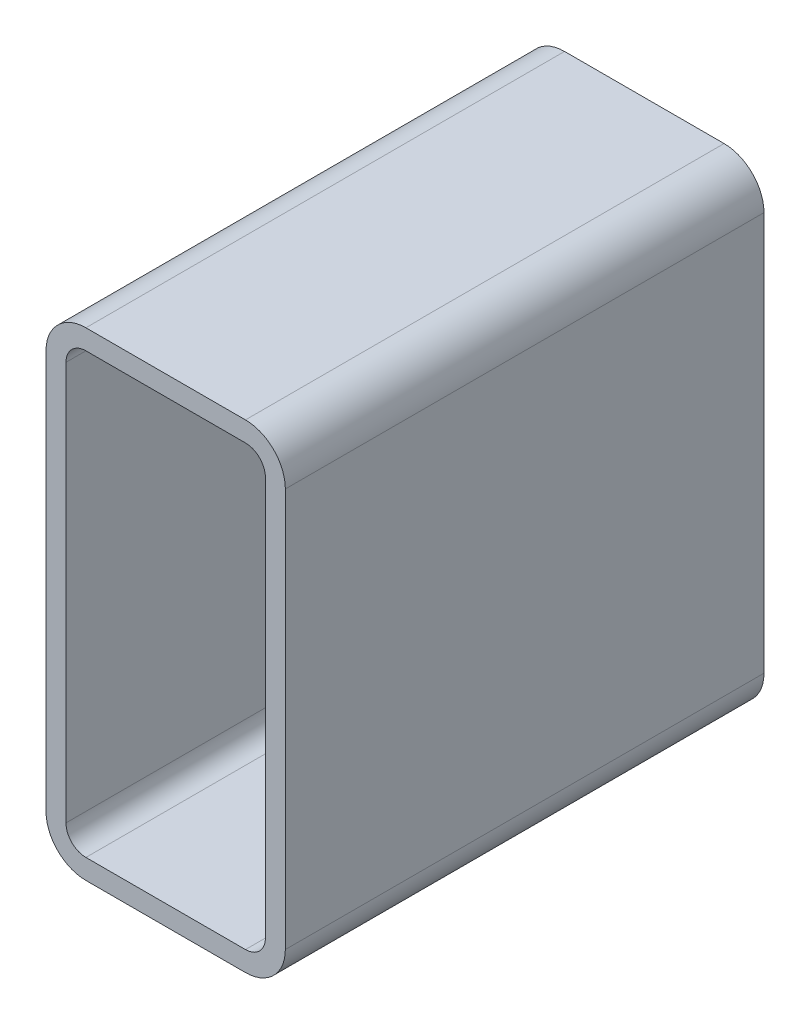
ISO-10303-21;
HEADER;
FILE_DESCRIPTION(('STEP AP214'),'2;1');
FILE_NAME('part.step','',(''),(''),'','','');
FILE_SCHEMA(('AUTOMOTIVE_DESIGN { 1 0 10303 214 1 1 1 1 }'));
ENDSEC;
DATA;
#1=APPLICATION_CONTEXT('core data for automotive mechanical design processes');
#2=APPLICATION_PROTOCOL_DEFINITION('international standard','automotive_design',2000,#1);
#3=PRODUCT_CONTEXT('',#1,'mechanical');
#4=PRODUCT('Part','Part','',(#3));
#5=PRODUCT_RELATED_PRODUCT_CATEGORY('part','',(#4));
#6=PRODUCT_DEFINITION_FORMATION('','',#4);
#7=PRODUCT_DEFINITION_CONTEXT('part definition',#1,'design');
#8=PRODUCT_DEFINITION('design','',#6,#7);
#9=PRODUCT_DEFINITION_SHAPE('','',#8);
#10=(LENGTH_UNIT() NAMED_UNIT(*) SI_UNIT(.MILLI.,.METRE.));
#11=(NAMED_UNIT(*) PLANE_ANGLE_UNIT() SI_UNIT($,.RADIAN.));
#12=(NAMED_UNIT(*) SI_UNIT($,.STERADIAN.) SOLID_ANGLE_UNIT());
#13=UNCERTAINTY_MEASURE_WITH_UNIT(LENGTH_MEASURE(1.E-05),#10,'distance_accuracy_value','');
#14=(GEOMETRIC_REPRESENTATION_CONTEXT(3) GLOBAL_UNCERTAINTY_ASSIGNED_CONTEXT((#13)) GLOBAL_UNIT_ASSIGNED_CONTEXT((#10,
#11,#12)) REPRESENTATION_CONTEXT('',''));
#15=CARTESIAN_POINT('',(0.,0.,0.));
#16=DIRECTION('',(0.,0.,1.));
#17=DIRECTION('',(1.,0.,0.));
#18=AXIS2_PLACEMENT_3D('',#15,#16,#17);
#19=CARTESIAN_POINT('',(25.4473013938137,281.274496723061,304.8));
#20=DIRECTION('',(0.,0.,1.));
#21=DIRECTION('',(1.,0.,0.));
#22=AXIS2_PLACEMENT_3D('',#19,#20,#21);
#23=PLANE('',#22);
#24=CARTESIAN_POINT('',(25.4473013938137,281.274496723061,304.8));
#25=DIRECTION('',(0.,0.,1.));
#26=DIRECTION('',(1.,0.,0.));
#27=AXIS2_PLACEMENT_3D('',#24,#25,#26);
#28=CIRCLE('',#27,25.4);
#29=CARTESIAN_POINT('',(25.4473013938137,306.674496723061,304.8));
#30=VERTEX_POINT('',#29);
#31=CARTESIAN_POINT('',(0.0473013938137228,281.274496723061,304.8));
#32=VERTEX_POINT('',#31);
#33=EDGE_CURVE('E211',#30,#32,#28,.T.);
#34=ORIENTED_EDGE('',*,*,#33,.T.);
#35=DIRECTION('',(0.,-1.,0.));
#36=VECTOR('',#35,1.);
#37=CARTESIAN_POINT('',(0.0473013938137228,27.2744967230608,304.8));
#38=LINE('',#37,#36);
#39=CARTESIAN_POINT('',(0.0473013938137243,27.2744967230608,304.8));
#40=VERTEX_POINT('',#39);
#41=EDGE_CURVE('E214',#32,#40,#38,.T.);
#42=ORIENTED_EDGE('',*,*,#41,.T.);
#43=CARTESIAN_POINT('',(25.4473013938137,27.2744967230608,304.8));
#44=DIRECTION('',(0.,0.,1.));
#45=DIRECTION('',(1.,0.,0.));
#46=AXIS2_PLACEMENT_3D('',#43,#44,#45);
#47=CIRCLE('',#46,25.4);
#48=CARTESIAN_POINT('',(25.4473013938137,1.87449672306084,304.8));
#49=VERTEX_POINT('',#48);
#50=EDGE_CURVE('E217',#40,#49,#47,.T.);
#51=ORIENTED_EDGE('',*,*,#50,.T.);
#52=DIRECTION('',(1.,0.,0.));
#53=VECTOR('',#52,1.);
#54=CARTESIAN_POINT('',(127.047301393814,1.87449672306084,304.8));
#55=LINE('',#54,#53);
#56=CARTESIAN_POINT('',(127.047301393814,1.87449672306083,304.8));
#57=VERTEX_POINT('',#56);
#58=EDGE_CURVE('E219',#49,#57,#55,.T.);
#59=ORIENTED_EDGE('',*,*,#58,.T.);
#60=CARTESIAN_POINT('',(127.047301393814,27.2744967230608,304.8));
#61=DIRECTION('',(0.,0.,1.));
#62=DIRECTION('',(1.,0.,0.));
#63=AXIS2_PLACEMENT_3D('',#60,#61,#62);
#64=CIRCLE('',#63,25.4);
#65=CARTESIAN_POINT('',(152.447301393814,27.2744967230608,304.8));
#66=VERTEX_POINT('',#65);
#67=EDGE_CURVE('E221',#57,#66,#64,.T.);
#68=ORIENTED_EDGE('',*,*,#67,.T.);
#69=DIRECTION('',(0.,1.,0.));
#70=VECTOR('',#69,1.);
#71=CARTESIAN_POINT('',(152.447301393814,281.274496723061,304.8));
#72=LINE('',#71,#70);
#73=CARTESIAN_POINT('',(152.447301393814,281.274496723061,304.8));
#74=VERTEX_POINT('',#73);
#75=EDGE_CURVE('E223',#66,#74,#72,.T.);
#76=ORIENTED_EDGE('',*,*,#75,.T.);
#77=CARTESIAN_POINT('',(127.047301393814,281.274496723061,304.8));
#78=DIRECTION('',(0.,0.,1.));
#79=DIRECTION('',(1.,0.,0.));
#80=AXIS2_PLACEMENT_3D('',#77,#78,#79);
#81=CIRCLE('',#80,25.4);
#82=CARTESIAN_POINT('',(127.047301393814,306.674496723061,304.8));
#83=VERTEX_POINT('',#82);
#84=EDGE_CURVE('E225',#74,#83,#81,.T.);
#85=ORIENTED_EDGE('',*,*,#84,.T.);
#86=DIRECTION('',(-1.,0.,0.));
#87=VECTOR('',#86,1.);
#88=CARTESIAN_POINT('',(25.4473013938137,306.674496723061,304.8));
#89=LINE('',#88,#87);
#90=EDGE_CURVE('E227',#83,#30,#89,.T.);
#91=ORIENTED_EDGE('',*,*,#90,.T.);
#92=EDGE_LOOP('',(#34,#42,#51,#59,#68,#76,#85,#91));
#93=FACE_BOUND('',#92,.T.);
#94=DIRECTION('',(0.,-1.,0.));
#95=VECTOR('',#94,1.);
#96=CARTESIAN_POINT('',(12.7473013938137,27.2744967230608,304.8));
#97=LINE('',#96,#95);
#98=CARTESIAN_POINT('',(12.7473013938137,281.274496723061,304.8));
#99=VERTEX_POINT('',#98);
#100=CARTESIAN_POINT('',(12.7473013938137,27.2744967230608,304.8));
#101=VERTEX_POINT('',#100);
#102=EDGE_CURVE('E154',#99,#101,#97,.T.);
#103=ORIENTED_EDGE('',*,*,#102,.F.);
#104=CARTESIAN_POINT('',(25.4473013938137,281.274496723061,304.8));
#105=DIRECTION('',(0.,0.,1.));
#106=DIRECTION('',(1.,0.,0.));
#107=AXIS2_PLACEMENT_3D('',#104,#105,#106);
#108=CIRCLE('',#107,12.7);
#109=CARTESIAN_POINT('',(25.4473013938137,293.974496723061,304.8));
#110=VERTEX_POINT('',#109);
#111=EDGE_CURVE('E146',#110,#99,#108,.T.);
#112=ORIENTED_EDGE('',*,*,#111,.F.);
#113=DIRECTION('',(-1.,0.,0.));
#114=VECTOR('',#113,1.);
#115=CARTESIAN_POINT('',(25.4473013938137,293.974496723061,304.8));
#116=LINE('',#115,#114);
#117=CARTESIAN_POINT('',(127.047301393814,293.974496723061,304.8));
#118=VERTEX_POINT('',#117);
#119=EDGE_CURVE('E179',#118,#110,#116,.T.);
#120=ORIENTED_EDGE('',*,*,#119,.F.);
#121=CARTESIAN_POINT('',(127.047301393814,281.274496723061,304.8));
#122=DIRECTION('',(0.,0.,1.));
#123=DIRECTION('',(1.,0.,0.));
#124=AXIS2_PLACEMENT_3D('',#121,#122,#123);
#125=CIRCLE('',#124,12.7);
#126=CARTESIAN_POINT('',(139.747301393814,281.274496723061,304.8));
#127=VERTEX_POINT('',#126);
#128=EDGE_CURVE('E177',#127,#118,#125,.T.);
#129=ORIENTED_EDGE('',*,*,#128,.F.);
#130=DIRECTION('',(0.,1.,0.));
#131=VECTOR('',#130,1.);
#132=CARTESIAN_POINT('',(139.747301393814,281.274496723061,304.8));
#133=LINE('',#132,#131);
#134=CARTESIAN_POINT('',(139.747301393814,27.2744967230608,304.8));
#135=VERTEX_POINT('',#134);
#136=EDGE_CURVE('E175',#135,#127,#133,.T.);
#137=ORIENTED_EDGE('',*,*,#136,.F.);
#138=CARTESIAN_POINT('',(127.047301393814,27.2744967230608,304.8));
#139=DIRECTION('',(0.,0.,1.));
#140=DIRECTION('',(1.,0.,0.));
#141=AXIS2_PLACEMENT_3D('',#138,#139,#140);
#142=CIRCLE('',#141,12.7);
#143=CARTESIAN_POINT('',(127.047301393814,14.5744967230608,304.8));
#144=VERTEX_POINT('',#143);
#145=EDGE_CURVE('E173',#144,#135,#142,.T.);
#146=ORIENTED_EDGE('',*,*,#145,.F.);
#147=DIRECTION('',(1.,0.,0.));
#148=VECTOR('',#147,1.);
#149=CARTESIAN_POINT('',(127.047301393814,14.5744967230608,304.8));
#150=LINE('',#149,#148);
#151=CARTESIAN_POINT('',(25.4473013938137,14.5744967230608,304.8));
#152=VERTEX_POINT('',#151);
#153=EDGE_CURVE('E169',#152,#144,#150,.T.);
#154=ORIENTED_EDGE('',*,*,#153,.F.);
#155=CARTESIAN_POINT('',(25.4473013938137,27.2744967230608,304.8));
#156=DIRECTION('',(0.,0.,1.));
#157=DIRECTION('',(1.,0.,0.));
#158=AXIS2_PLACEMENT_3D('',#155,#156,#157);
#159=CIRCLE('',#158,12.7);
#160=EDGE_CURVE('E167',#101,#152,#159,.T.);
#161=ORIENTED_EDGE('',*,*,#160,.F.);
#162=EDGE_LOOP('',(#103,#112,#120,#129,#137,#146,#154,#161));
#163=FACE_BOUND('',#162,.T.);
#164=ADVANCED_FACE('F33',(#93,#163),#23,.T.);
#165=CARTESIAN_POINT('',(25.4473013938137,281.274496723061,0.));
#166=DIRECTION('',(0.,0.,1.));
#167=DIRECTION('',(1.,0.,0.));
#168=AXIS2_PLACEMENT_3D('',#165,#166,#167);
#169=PLANE('',#168);
#170=CARTESIAN_POINT('',(25.4473013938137,281.274496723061,0.));
#171=DIRECTION('',(0.,0.,1.));
#172=DIRECTION('',(1.,0.,0.));
#173=AXIS2_PLACEMENT_3D('',#170,#171,#172);
#174=CIRCLE('',#173,25.4);
#175=CARTESIAN_POINT('',(25.4473013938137,306.674496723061,0.));
#176=VERTEX_POINT('',#175);
#177=CARTESIAN_POINT('',(0.0473013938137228,281.274496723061,0.));
#178=VERTEX_POINT('',#177);
#179=EDGE_CURVE('E162',#176,#178,#174,.T.);
#180=ORIENTED_EDGE('',*,*,#179,.F.);
#181=DIRECTION('',(-1.,0.,0.));
#182=VECTOR('',#181,1.);
#183=CARTESIAN_POINT('',(25.4473013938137,306.674496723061,0.));
#184=LINE('',#183,#182);
#185=CARTESIAN_POINT('',(127.047301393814,306.674496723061,0.));
#186=VERTEX_POINT('',#185);
#187=EDGE_CURVE('E215',#186,#176,#184,.T.);
#188=ORIENTED_EDGE('',*,*,#187,.F.);
#189=CARTESIAN_POINT('',(127.047301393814,281.274496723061,0.));
#190=DIRECTION('',(0.,0.,1.));
#191=DIRECTION('',(1.,0.,0.));
#192=AXIS2_PLACEMENT_3D('',#189,#190,#191);
#193=CIRCLE('',#192,25.4);
#194=CARTESIAN_POINT('',(152.447301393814,281.274496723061,0.));
#195=VERTEX_POINT('',#194);
#196=EDGE_CURVE('E242',#195,#186,#193,.T.);
#197=ORIENTED_EDGE('',*,*,#196,.F.);
#198=DIRECTION('',(0.,1.,0.));
#199=VECTOR('',#198,1.);
#200=CARTESIAN_POINT('',(152.447301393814,281.274496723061,0.));
#201=LINE('',#200,#199);
#202=CARTESIAN_POINT('',(152.447301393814,27.2744967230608,0.));
#203=VERTEX_POINT('',#202);
#204=EDGE_CURVE('E240',#203,#195,#201,.T.);
#205=ORIENTED_EDGE('',*,*,#204,.F.);
#206=CARTESIAN_POINT('',(127.047301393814,27.2744967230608,0.));
#207=DIRECTION('',(0.,0.,1.));
#208=DIRECTION('',(1.,0.,0.));
#209=AXIS2_PLACEMENT_3D('',#206,#207,#208);
#210=CIRCLE('',#209,25.4);
#211=CARTESIAN_POINT('',(127.047301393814,1.87449672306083,0.));
#212=VERTEX_POINT('',#211);
#213=EDGE_CURVE('E238',#212,#203,#210,.T.);
#214=ORIENTED_EDGE('',*,*,#213,.F.);
#215=DIRECTION('',(1.,0.,0.));
#216=VECTOR('',#215,1.);
#217=CARTESIAN_POINT('',(127.047301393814,1.87449672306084,0.));
#218=LINE('',#217,#216);
#219=CARTESIAN_POINT('',(25.4473013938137,1.87449672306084,0.));
#220=VERTEX_POINT('',#219);
#221=EDGE_CURVE('E236',#220,#212,#218,.T.);
#222=ORIENTED_EDGE('',*,*,#221,.F.);
#223=CARTESIAN_POINT('',(25.4473013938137,27.2744967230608,0.));
#224=DIRECTION('',(0.,0.,1.));
#225=DIRECTION('',(1.,0.,0.));
#226=AXIS2_PLACEMENT_3D('',#223,#224,#225);
#227=CIRCLE('',#226,25.4);
#228=CARTESIAN_POINT('',(0.0473013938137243,27.2744967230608,0.));
#229=VERTEX_POINT('',#228);
#230=EDGE_CURVE('E234',#229,#220,#227,.T.);
#231=ORIENTED_EDGE('',*,*,#230,.F.);
#232=DIRECTION('',(0.,-1.,0.));
#233=VECTOR('',#232,1.);
#234=CARTESIAN_POINT('',(0.0473013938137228,27.2744967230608,0.));
#235=LINE('',#234,#233);
#236=EDGE_CURVE('E232',#178,#229,#235,.T.);
#237=ORIENTED_EDGE('',*,*,#236,.F.);
#238=EDGE_LOOP('',(#180,#188,#197,#205,#214,#222,#231,#237));
#239=FACE_BOUND('',#238,.T.);
#240=CARTESIAN_POINT('',(25.4473013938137,281.274496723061,0.));
#241=DIRECTION('',(0.,0.,1.));
#242=DIRECTION('',(1.,0.,0.));
#243=AXIS2_PLACEMENT_3D('',#240,#241,#242);
#244=CIRCLE('',#243,12.7);
#245=CARTESIAN_POINT('',(25.4473013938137,293.974496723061,0.));
#246=VERTEX_POINT('',#245);
#247=CARTESIAN_POINT('',(12.7473013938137,281.274496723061,0.));
#248=VERTEX_POINT('',#247);
#249=EDGE_CURVE('E56',#246,#248,#244,.T.);
#250=ORIENTED_EDGE('',*,*,#249,.T.);
#251=DIRECTION('',(0.,-1.,0.));
#252=VECTOR('',#251,1.);
#253=CARTESIAN_POINT('',(12.7473013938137,27.2744967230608,0.));
#254=LINE('',#253,#252);
#255=CARTESIAN_POINT('',(12.7473013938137,27.2744967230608,0.));
#256=VERTEX_POINT('',#255);
#257=EDGE_CURVE('E161',#248,#256,#254,.T.);
#258=ORIENTED_EDGE('',*,*,#257,.T.);
#259=CARTESIAN_POINT('',(25.4473013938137,27.2744967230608,0.));
#260=DIRECTION('',(0.,0.,1.));
#261=DIRECTION('',(1.,0.,0.));
#262=AXIS2_PLACEMENT_3D('',#259,#260,#261);
#263=CIRCLE('',#262,12.7);
#264=CARTESIAN_POINT('',(25.4473013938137,14.5744967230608,0.));
#265=VERTEX_POINT('',#264);
#266=EDGE_CURVE('E183',#256,#265,#263,.T.);
#267=ORIENTED_EDGE('',*,*,#266,.T.);
#268=DIRECTION('',(1.,0.,0.));
#269=VECTOR('',#268,1.);
#270=CARTESIAN_POINT('',(127.047301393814,14.5744967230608,0.));
#271=LINE('',#270,#269);
#272=CARTESIAN_POINT('',(127.047301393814,14.5744967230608,0.));
#273=VERTEX_POINT('',#272);
#274=EDGE_CURVE('E186',#265,#273,#271,.T.);
#275=ORIENTED_EDGE('',*,*,#274,.T.);
#276=CARTESIAN_POINT('',(127.047301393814,27.2744967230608,0.));
#277=DIRECTION('',(0.,0.,1.));
#278=DIRECTION('',(1.,0.,0.));
#279=AXIS2_PLACEMENT_3D('',#276,#277,#278);
#280=CIRCLE('',#279,12.7);
#281=CARTESIAN_POINT('',(139.747301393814,27.2744967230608,0.));
#282=VERTEX_POINT('',#281);
#283=EDGE_CURVE('E189',#273,#282,#280,.T.);
#284=ORIENTED_EDGE('',*,*,#283,.T.);
#285=DIRECTION('',(0.,1.,0.));
#286=VECTOR('',#285,1.);
#287=CARTESIAN_POINT('',(139.747301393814,281.274496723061,0.));
#288=LINE('',#287,#286);
#289=CARTESIAN_POINT('',(139.747301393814,281.274496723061,0.));
#290=VERTEX_POINT('',#289);
#291=EDGE_CURVE('E192',#282,#290,#288,.T.);
#292=ORIENTED_EDGE('',*,*,#291,.T.);
#293=CARTESIAN_POINT('',(127.047301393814,281.274496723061,0.));
#294=DIRECTION('',(0.,0.,1.));
#295=DIRECTION('',(1.,0.,0.));
#296=AXIS2_PLACEMENT_3D('',#293,#294,#295);
#297=CIRCLE('',#296,12.7);
#298=CARTESIAN_POINT('',(127.047301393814,293.974496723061,0.));
#299=VERTEX_POINT('',#298);
#300=EDGE_CURVE('E195',#290,#299,#297,.T.);
#301=ORIENTED_EDGE('',*,*,#300,.T.);
#302=DIRECTION('',(-1.,0.,0.));
#303=VECTOR('',#302,1.);
#304=CARTESIAN_POINT('',(25.4473013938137,293.974496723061,0.));
#305=LINE('',#304,#303);
#306=EDGE_CURVE('E155',#299,#246,#305,.T.);
#307=ORIENTED_EDGE('',*,*,#306,.T.);
#308=EDGE_LOOP('',(#250,#258,#267,#275,#284,#292,#301,#307));
#309=FACE_BOUND('',#308,.T.);
#310=ADVANCED_FACE('F272',(#239,#309),#169,.F.);
#311=CARTESIAN_POINT('',(25.4473013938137,281.274496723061,304.8));
#312=DIRECTION('',(0.,0.,-1.));
#313=DIRECTION('',(-1.,0.,0.));
#314=AXIS2_PLACEMENT_3D('',#311,#312,#313);
#315=CYLINDRICAL_SURFACE('',#314,25.4);
#316=ORIENTED_EDGE('',*,*,#179,.T.);
#317=DIRECTION('',(0.,0.,-1.));
#318=VECTOR('',#317,1.);
#319=CARTESIAN_POINT('',(0.0473013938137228,281.274496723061,304.8));
#320=LINE('',#319,#318);
#321=EDGE_CURVE('E11',#32,#178,#320,.T.);
#322=ORIENTED_EDGE('',*,*,#321,.F.);
#323=ORIENTED_EDGE('',*,*,#33,.F.);
#324=DIRECTION('',(0.,0.,-1.));
#325=VECTOR('',#324,1.);
#326=CARTESIAN_POINT('',(25.4473013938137,306.674496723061,304.8));
#327=LINE('',#326,#325);
#328=EDGE_CURVE('E229',#30,#176,#327,.T.);
#329=ORIENTED_EDGE('',*,*,#328,.T.);
#330=EDGE_LOOP('',(#316,#322,#323,#329));
#331=FACE_BOUND('',#330,.T.);
#332=ADVANCED_FACE('F35',(#331),#315,.T.);
#333=CARTESIAN_POINT('',(0.0473013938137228,27.2744967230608,304.8));
#334=DIRECTION('',(1.,0.,0.));
#335=DIRECTION('',(0.,0.,-1.));
#336=AXIS2_PLACEMENT_3D('',#333,#334,#335);
#337=PLANE('',#336);
#338=ORIENTED_EDGE('',*,*,#236,.T.);
#339=DIRECTION('',(0.,0.,-1.));
#340=VECTOR('',#339,1.);
#341=CARTESIAN_POINT('',(0.0473013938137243,27.2744967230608,304.8));
#342=LINE('',#341,#340);
#343=EDGE_CURVE('E41',#40,#229,#342,.T.);
#344=ORIENTED_EDGE('',*,*,#343,.F.);
#345=ORIENTED_EDGE('',*,*,#41,.F.);
#346=ORIENTED_EDGE('',*,*,#321,.T.);
#347=EDGE_LOOP('',(#338,#344,#345,#346));
#348=FACE_BOUND('',#347,.T.);
#349=ADVANCED_FACE('F289',(#348),#337,.F.);
#350=CARTESIAN_POINT('',(25.4473013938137,27.2744967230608,304.8));
#351=DIRECTION('',(0.,0.,-1.));
#352=DIRECTION('',(-1.,0.,0.));
#353=AXIS2_PLACEMENT_3D('',#350,#351,#352);
#354=CYLINDRICAL_SURFACE('',#353,25.4);
#355=ORIENTED_EDGE('',*,*,#230,.T.);
#356=DIRECTION('',(0.,0.,-1.));
#357=VECTOR('',#356,1.);
#358=CARTESIAN_POINT('',(25.4473013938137,1.87449672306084,304.8));
#359=LINE('',#358,#357);
#360=EDGE_CURVE('E259',#49,#220,#359,.T.);
#361=ORIENTED_EDGE('',*,*,#360,.F.);
#362=ORIENTED_EDGE('',*,*,#50,.F.);
#363=ORIENTED_EDGE('',*,*,#343,.T.);
#364=EDGE_LOOP('',(#355,#361,#362,#363));
#365=FACE_BOUND('',#364,.T.);
#366=ADVANCED_FACE('F266',(#365),#354,.T.);
#367=CARTESIAN_POINT('',(127.047301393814,1.87449672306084,304.8));
#368=DIRECTION('',(0.,1.,0.));
#369=DIRECTION('',(0.,0.,1.));
#370=AXIS2_PLACEMENT_3D('',#367,#368,#369);
#371=PLANE('',#370);
#372=ORIENTED_EDGE('',*,*,#221,.T.);
#373=DIRECTION('',(0.,0.,-1.));
#374=VECTOR('',#373,1.);
#375=CARTESIAN_POINT('',(127.047301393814,1.87449672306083,304.8));
#376=LINE('',#375,#374);
#377=EDGE_CURVE('E256',#57,#212,#376,.T.);
#378=ORIENTED_EDGE('',*,*,#377,.F.);
#379=ORIENTED_EDGE('',*,*,#58,.F.);
#380=ORIENTED_EDGE('',*,*,#360,.T.);
#381=EDGE_LOOP('',(#372,#378,#379,#380));
#382=FACE_BOUND('',#381,.T.);
#383=ADVANCED_FACE('F278',(#382),#371,.F.);
#384=CARTESIAN_POINT('',(127.047301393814,27.2744967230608,304.8));
#385=DIRECTION('',(0.,0.,-1.));
#386=DIRECTION('',(-1.,0.,0.));
#387=AXIS2_PLACEMENT_3D('',#384,#385,#386);
#388=CYLINDRICAL_SURFACE('',#387,25.4);
#389=ORIENTED_EDGE('',*,*,#213,.T.);
#390=DIRECTION('',(0.,0.,-1.));
#391=VECTOR('',#390,1.);
#392=CARTESIAN_POINT('',(152.447301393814,27.2744967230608,304.8));
#393=LINE('',#392,#391);
#394=EDGE_CURVE('E253',#66,#203,#393,.T.);
#395=ORIENTED_EDGE('',*,*,#394,.F.);
#396=ORIENTED_EDGE('',*,*,#67,.F.);
#397=ORIENTED_EDGE('',*,*,#377,.T.);
#398=EDGE_LOOP('',(#389,#395,#396,#397));
#399=FACE_BOUND('',#398,.T.);
#400=ADVANCED_FACE('F282',(#399),#388,.T.);
#401=CARTESIAN_POINT('',(152.447301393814,281.274496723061,304.8));
#402=DIRECTION('',(-1.,0.,0.));
#403=DIRECTION('',(0.,0.,1.));
#404=AXIS2_PLACEMENT_3D('',#401,#402,#403);
#405=PLANE('',#404);
#406=ORIENTED_EDGE('',*,*,#204,.T.);
#407=DIRECTION('',(0.,0.,-1.));
#408=VECTOR('',#407,1.);
#409=CARTESIAN_POINT('',(152.447301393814,281.274496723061,304.8));
#410=LINE('',#409,#408);
#411=EDGE_CURVE('E250',#74,#195,#410,.T.);
#412=ORIENTED_EDGE('',*,*,#411,.F.);
#413=ORIENTED_EDGE('',*,*,#75,.F.);
#414=ORIENTED_EDGE('',*,*,#394,.T.);
#415=EDGE_LOOP('',(#406,#412,#413,#414));
#416=FACE_BOUND('',#415,.T.);
#417=ADVANCED_FACE('F302',(#416),#405,.F.);
#418=CARTESIAN_POINT('',(127.047301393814,281.274496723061,304.8));
#419=DIRECTION('',(0.,0.,-1.));
#420=DIRECTION('',(-1.,0.,0.));
#421=AXIS2_PLACEMENT_3D('',#418,#419,#420);
#422=CYLINDRICAL_SURFACE('',#421,25.4);
#423=ORIENTED_EDGE('',*,*,#196,.T.);
#424=DIRECTION('',(0.,0.,-1.));
#425=VECTOR('',#424,1.);
#426=CARTESIAN_POINT('',(127.047301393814,306.674496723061,304.8));
#427=LINE('',#426,#425);
#428=EDGE_CURVE('E247',#83,#186,#427,.T.);
#429=ORIENTED_EDGE('',*,*,#428,.F.);
#430=ORIENTED_EDGE('',*,*,#84,.F.);
#431=ORIENTED_EDGE('',*,*,#411,.T.);
#432=EDGE_LOOP('',(#423,#429,#430,#431));
#433=FACE_BOUND('',#432,.T.);
#434=ADVANCED_FACE('F300',(#433),#422,.T.);
#435=CARTESIAN_POINT('',(25.4473013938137,306.674496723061,304.8));
#436=DIRECTION('',(0.,-1.,0.));
#437=DIRECTION('',(0.,0.,-1.));
#438=AXIS2_PLACEMENT_3D('',#435,#436,#437);
#439=PLANE('',#438);
#440=ORIENTED_EDGE('',*,*,#187,.T.);
#441=ORIENTED_EDGE('',*,*,#328,.F.);
#442=ORIENTED_EDGE('',*,*,#90,.F.);
#443=ORIENTED_EDGE('',*,*,#428,.T.);
#444=EDGE_LOOP('',(#440,#441,#442,#443));
#445=FACE_BOUND('',#444,.T.);
#446=ADVANCED_FACE('F295',(#445),#439,.F.);
#447=CARTESIAN_POINT('',(25.4473013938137,281.274496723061,304.8));
#448=DIRECTION('',(0.,0.,-1.));
#449=DIRECTION('',(-1.,0.,0.));
#450=AXIS2_PLACEMENT_3D('',#447,#448,#449);
#451=CYLINDRICAL_SURFACE('',#450,12.7);
#452=ORIENTED_EDGE('',*,*,#249,.F.);
#453=DIRECTION('',(0.,0.,-1.));
#454=VECTOR('',#453,1.);
#455=CARTESIAN_POINT('',(25.4473013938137,293.974496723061,304.8));
#456=LINE('',#455,#454);
#457=EDGE_CURVE('E150',#110,#246,#456,.T.);
#458=ORIENTED_EDGE('',*,*,#457,.F.);
#459=ORIENTED_EDGE('',*,*,#111,.T.);
#460=DIRECTION('',(0.,0.,-1.));
#461=VECTOR('',#460,1.);
#462=CARTESIAN_POINT('',(12.7473013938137,281.274496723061,304.8));
#463=LINE('',#462,#461);
#464=EDGE_CURVE('E149',#99,#248,#463,.T.);
#465=ORIENTED_EDGE('',*,*,#464,.T.);
#466=EDGE_LOOP('',(#452,#458,#459,#465));
#467=FACE_BOUND('',#466,.T.);
#468=ADVANCED_FACE('F148',(#467),#451,.F.);
#469=CARTESIAN_POINT('',(12.7473013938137,27.2744967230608,304.8));
#470=DIRECTION('',(1.,0.,0.));
#471=DIRECTION('',(0.,0.,-1.));
#472=AXIS2_PLACEMENT_3D('',#469,#470,#471);
#473=PLANE('',#472);
#474=ORIENTED_EDGE('',*,*,#257,.F.);
#475=ORIENTED_EDGE('',*,*,#464,.F.);
#476=ORIENTED_EDGE('',*,*,#102,.T.);
#477=DIRECTION('',(0.,0.,-1.));
#478=VECTOR('',#477,1.);
#479=CARTESIAN_POINT('',(12.7473013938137,27.2744967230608,304.8));
#480=LINE('',#479,#478);
#481=EDGE_CURVE('E163',#101,#256,#480,.T.);
#482=ORIENTED_EDGE('',*,*,#481,.T.);
#483=EDGE_LOOP('',(#474,#475,#476,#482));
#484=FACE_BOUND('',#483,.T.);
#485=ADVANCED_FACE('F158',(#484),#473,.T.);
#486=CARTESIAN_POINT('',(25.4473013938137,27.2744967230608,304.8));
#487=DIRECTION('',(0.,0.,-1.));
#488=DIRECTION('',(-1.,0.,0.));
#489=AXIS2_PLACEMENT_3D('',#486,#487,#488);
#490=CYLINDRICAL_SURFACE('',#489,12.7);
#491=ORIENTED_EDGE('',*,*,#266,.F.);
#492=ORIENTED_EDGE('',*,*,#481,.F.);
#493=ORIENTED_EDGE('',*,*,#160,.T.);
#494=DIRECTION('',(0.,0.,-1.));
#495=VECTOR('',#494,1.);
#496=CARTESIAN_POINT('',(25.4473013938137,14.5744967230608,304.8));
#497=LINE('',#496,#495);
#498=EDGE_CURVE('E208',#152,#265,#497,.T.);
#499=ORIENTED_EDGE('',*,*,#498,.T.);
#500=EDGE_LOOP('',(#491,#492,#493,#499));
#501=FACE_BOUND('',#500,.T.);
#502=ADVANCED_FACE('F327',(#501),#490,.F.);
#503=CARTESIAN_POINT('',(127.047301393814,14.5744967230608,304.8));
#504=DIRECTION('',(0.,1.,0.));
#505=DIRECTION('',(0.,0.,1.));
#506=AXIS2_PLACEMENT_3D('',#503,#504,#505);
#507=PLANE('',#506);
#508=ORIENTED_EDGE('',*,*,#274,.F.);
#509=ORIENTED_EDGE('',*,*,#498,.F.);
#510=ORIENTED_EDGE('',*,*,#153,.T.);
#511=DIRECTION('',(0.,0.,-1.));
#512=VECTOR('',#511,1.);
#513=CARTESIAN_POINT('',(127.047301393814,14.5744967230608,304.8));
#514=LINE('',#513,#512);
#515=EDGE_CURVE('E206',#144,#273,#514,.T.);
#516=ORIENTED_EDGE('',*,*,#515,.T.);
#517=EDGE_LOOP('',(#508,#509,#510,#516));
#518=FACE_BOUND('',#517,.T.);
#519=ADVANCED_FACE('F331',(#518),#507,.T.);
#520=CARTESIAN_POINT('',(127.047301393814,27.2744967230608,304.8));
#521=DIRECTION('',(0.,0.,-1.));
#522=DIRECTION('',(-1.,0.,0.));
#523=AXIS2_PLACEMENT_3D('',#520,#521,#522);
#524=CYLINDRICAL_SURFACE('',#523,12.7);
#525=ORIENTED_EDGE('',*,*,#283,.F.);
#526=ORIENTED_EDGE('',*,*,#515,.F.);
#527=ORIENTED_EDGE('',*,*,#145,.T.);
#528=DIRECTION('',(0.,0.,-1.));
#529=VECTOR('',#528,1.);
#530=CARTESIAN_POINT('',(139.747301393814,27.2744967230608,304.8));
#531=LINE('',#530,#529);
#532=EDGE_CURVE('E204',#135,#282,#531,.T.);
#533=ORIENTED_EDGE('',*,*,#532,.T.);
#534=EDGE_LOOP('',(#525,#526,#527,#533));
#535=FACE_BOUND('',#534,.T.);
#536=ADVANCED_FACE('F337',(#535),#524,.F.);
#537=CARTESIAN_POINT('',(139.747301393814,281.274496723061,304.8));
#538=DIRECTION('',(-1.,0.,0.));
#539=DIRECTION('',(0.,0.,1.));
#540=AXIS2_PLACEMENT_3D('',#537,#538,#539);
#541=PLANE('',#540);
#542=ORIENTED_EDGE('',*,*,#291,.F.);
#543=ORIENTED_EDGE('',*,*,#532,.F.);
#544=ORIENTED_EDGE('',*,*,#136,.T.);
#545=DIRECTION('',(0.,0.,-1.));
#546=VECTOR('',#545,1.);
#547=CARTESIAN_POINT('',(139.747301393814,281.274496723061,304.8));
#548=LINE('',#547,#546);
#549=EDGE_CURVE('E202',#127,#290,#548,.T.);
#550=ORIENTED_EDGE('',*,*,#549,.T.);
#551=EDGE_LOOP('',(#542,#543,#544,#550));
#552=FACE_BOUND('',#551,.T.);
#553=ADVANCED_FACE('F341',(#552),#541,.T.);
#554=CARTESIAN_POINT('',(127.047301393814,281.274496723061,304.8));
#555=DIRECTION('',(0.,0.,-1.));
#556=DIRECTION('',(-1.,0.,0.));
#557=AXIS2_PLACEMENT_3D('',#554,#555,#556);
#558=CYLINDRICAL_SURFACE('',#557,12.7);
#559=ORIENTED_EDGE('',*,*,#300,.F.);
#560=ORIENTED_EDGE('',*,*,#549,.F.);
#561=ORIENTED_EDGE('',*,*,#128,.T.);
#562=DIRECTION('',(0.,0.,-1.));
#563=VECTOR('',#562,1.);
#564=CARTESIAN_POINT('',(127.047301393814,293.974496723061,304.8));
#565=LINE('',#564,#563);
#566=EDGE_CURVE('E48',#118,#299,#565,.T.);
#567=ORIENTED_EDGE('',*,*,#566,.T.);
#568=EDGE_LOOP('',(#559,#560,#561,#567));
#569=FACE_BOUND('',#568,.T.);
#570=ADVANCED_FACE('F345',(#569),#558,.F.);
#571=CARTESIAN_POINT('',(25.4473013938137,293.974496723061,304.8));
#572=DIRECTION('',(0.,-1.,0.));
#573=DIRECTION('',(0.,0.,-1.));
#574=AXIS2_PLACEMENT_3D('',#571,#572,#573);
#575=PLANE('',#574);
#576=ORIENTED_EDGE('',*,*,#306,.F.);
#577=ORIENTED_EDGE('',*,*,#566,.F.);
#578=ORIENTED_EDGE('',*,*,#119,.T.);
#579=ORIENTED_EDGE('',*,*,#457,.T.);
#580=EDGE_LOOP('',(#576,#577,#578,#579));
#581=FACE_BOUND('',#580,.T.);
#582=ADVANCED_FACE('F349',(#581),#575,.T.);
#583=CLOSED_SHELL('',(#164,#310,#332,#349,#366,#383,#400,#417,#434,#446,#468,#485,#502,#519,
#536,#553,#570,#582));
#584=MANIFOLD_SOLID_BREP('B2',#583);
#585=ADVANCED_BREP_SHAPE_REPRESENTATION('',(#18,#584),#14);
#586=SHAPE_DEFINITION_REPRESENTATION(#9,#585);
ENDSEC;
END-ISO-10303-21;
